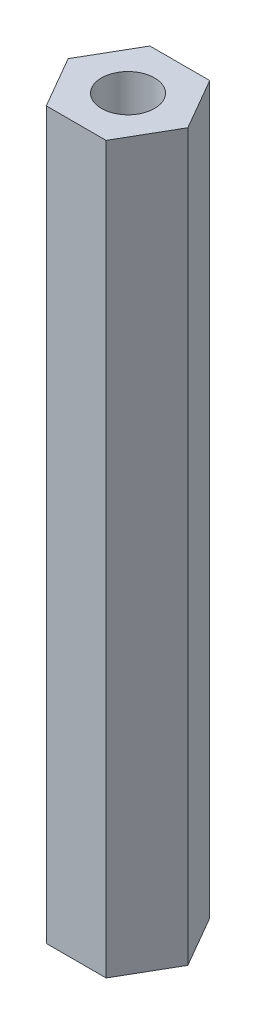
ISO-10303-21;
HEADER;
FILE_DESCRIPTION(('STEP AP214'),'2;1');
FILE_NAME('part.step','',(''),(''),'','','');
FILE_SCHEMA(('AUTOMOTIVE_DESIGN { 1 0 10303 214 1 1 1 1 }'));
ENDSEC;
DATA;
#1=APPLICATION_CONTEXT('core data for automotive mechanical design processes');
#2=APPLICATION_PROTOCOL_DEFINITION('international standard','automotive_design',2000,#1);
#3=PRODUCT_CONTEXT('',#1,'mechanical');
#4=PRODUCT('Part','Part','',(#3));
#5=PRODUCT_RELATED_PRODUCT_CATEGORY('part','',(#4));
#6=PRODUCT_DEFINITION_FORMATION('','',#4);
#7=PRODUCT_DEFINITION_CONTEXT('part definition',#1,'design');
#8=PRODUCT_DEFINITION('design','',#6,#7);
#9=PRODUCT_DEFINITION_SHAPE('','',#8);
#10=(LENGTH_UNIT() NAMED_UNIT(*) SI_UNIT(.MILLI.,.METRE.));
#11=(NAMED_UNIT(*) PLANE_ANGLE_UNIT() SI_UNIT($,.RADIAN.));
#12=(NAMED_UNIT(*) SI_UNIT($,.STERADIAN.) SOLID_ANGLE_UNIT());
#13=UNCERTAINTY_MEASURE_WITH_UNIT(LENGTH_MEASURE(1.E-05),#10,'distance_accuracy_value','');
#14=(GEOMETRIC_REPRESENTATION_CONTEXT(3) GLOBAL_UNCERTAINTY_ASSIGNED_CONTEXT((#13)) GLOBAL_UNIT_ASSIGNED_CONTEXT((#10,
#11,#12)) REPRESENTATION_CONTEXT('',''));
#15=CARTESIAN_POINT('',(0.,0.,0.));
#16=DIRECTION('',(0.,0.,1.));
#17=DIRECTION('',(1.,0.,0.));
#18=AXIS2_PLACEMENT_3D('',#15,#16,#17);
#19=CARTESIAN_POINT('',(0.,44.45,0.));
#20=DIRECTION('',(0.,1.,0.));
#21=DIRECTION('',(0.,0.,1.));
#22=AXIS2_PLACEMENT_3D('',#19,#20,#21);
#23=PLANE('',#22);
#24=DIRECTION('',(-0.500000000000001,0.,-0.866025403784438));
#25=VECTOR('',#24,1.);
#26=CARTESIAN_POINT('',(3.66617420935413,44.45,0.));
#27=LINE('',#26,#25);
#28=CARTESIAN_POINT('',(3.66617420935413,44.45,0.));
#29=VERTEX_POINT('',#28);
#30=CARTESIAN_POINT('',(1.83308710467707,44.45,-3.175));
#31=VERTEX_POINT('',#30);
#32=EDGE_CURVE('E128',#29,#31,#27,.T.);
#33=ORIENTED_EDGE('',*,*,#32,.T.);
#34=DIRECTION('',(-1.,0.,0.));
#35=VECTOR('',#34,1.);
#36=CARTESIAN_POINT('',(1.83308710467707,44.45,-3.175));
#37=LINE('',#36,#35);
#38=CARTESIAN_POINT('',(-1.83308710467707,44.45,-3.175));
#39=VERTEX_POINT('',#38);
#40=EDGE_CURVE('E86',#31,#39,#37,.T.);
#41=ORIENTED_EDGE('',*,*,#40,.T.);
#42=DIRECTION('',(-0.500000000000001,0.,0.866025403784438));
#43=VECTOR('',#42,1.);
#44=CARTESIAN_POINT('',(-1.83308710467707,44.45,-3.175));
#45=LINE('',#44,#43);
#46=CARTESIAN_POINT('',(-3.66617420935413,44.45,0.));
#47=VERTEX_POINT('',#46);
#48=EDGE_CURVE('E99',#39,#47,#45,.T.);
#49=ORIENTED_EDGE('',*,*,#48,.T.);
#50=DIRECTION('',(0.5,0.,0.866025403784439));
#51=VECTOR('',#50,1.);
#52=CARTESIAN_POINT('',(-3.66617420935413,44.45,0.));
#53=LINE('',#52,#51);
#54=CARTESIAN_POINT('',(-1.83308710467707,44.45,3.175));
#55=VERTEX_POINT('',#54);
#56=EDGE_CURVE('E93',#47,#55,#53,.T.);
#57=ORIENTED_EDGE('',*,*,#56,.T.);
#58=DIRECTION('',(1.,0.,0.));
#59=VECTOR('',#58,1.);
#60=CARTESIAN_POINT('',(-1.83308710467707,44.45,3.175));
#61=LINE('',#60,#59);
#62=CARTESIAN_POINT('',(1.83308710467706,44.45,3.175));
#63=VERTEX_POINT('',#62);
#64=EDGE_CURVE('E97',#55,#63,#61,.T.);
#65=ORIENTED_EDGE('',*,*,#64,.T.);
#66=DIRECTION('',(0.500000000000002,0.,-0.866025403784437));
#67=VECTOR('',#66,1.);
#68=CARTESIAN_POINT('',(1.83308710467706,44.45,3.175));
#69=LINE('',#68,#67);
#70=EDGE_CURVE('E49',#63,#29,#69,.T.);
#71=ORIENTED_EDGE('',*,*,#70,.T.);
#72=EDGE_LOOP('',(#33,#41,#49,#57,#65,#71));
#73=FACE_BOUND('',#72,.T.);
#74=CARTESIAN_POINT('',(0.,44.45,0.));
#75=DIRECTION('',(0.,1.,0.));
#76=DIRECTION('',(0.,0.,1.));
#77=AXIS2_PLACEMENT_3D('',#74,#75,#76);
#78=CIRCLE('',#77,1.6256);
#79=CARTESIAN_POINT('',(0.,44.45,1.6256));
#80=VERTEX_POINT('',#79);
#81=EDGE_CURVE('E121',#80,#80,#78,.T.);
#82=ORIENTED_EDGE('',*,*,#81,.F.);
#83=EDGE_LOOP('',(#82));
#84=FACE_BOUND('',#83,.T.);
#85=ADVANCED_FACE('F32',(#73,#84),#23,.T.);
#86=CARTESIAN_POINT('',(0.,0.,0.));
#87=DIRECTION('',(0.,1.,0.));
#88=DIRECTION('',(0.,0.,1.));
#89=AXIS2_PLACEMENT_3D('',#86,#87,#88);
#90=PLANE('',#89);
#91=DIRECTION('',(-0.500000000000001,0.,-0.866025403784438));
#92=VECTOR('',#91,1.);
#93=CARTESIAN_POINT('',(3.66617420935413,0.,0.));
#94=LINE('',#93,#92);
#95=CARTESIAN_POINT('',(3.66617420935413,0.,0.));
#96=VERTEX_POINT('',#95);
#97=CARTESIAN_POINT('',(1.83308710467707,0.,-3.175));
#98=VERTEX_POINT('',#97);
#99=EDGE_CURVE('E117',#96,#98,#94,.T.);
#100=ORIENTED_EDGE('',*,*,#99,.F.);
#101=DIRECTION('',(0.500000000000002,0.,-0.866025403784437));
#102=VECTOR('',#101,1.);
#103=CARTESIAN_POINT('',(1.83308710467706,0.,3.175));
#104=LINE('',#103,#102);
#105=CARTESIAN_POINT('',(1.83308710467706,0.,3.175));
#106=VERTEX_POINT('',#105);
#107=EDGE_CURVE('E78',#106,#96,#104,.T.);
#108=ORIENTED_EDGE('',*,*,#107,.F.);
#109=DIRECTION('',(1.,0.,0.));
#110=VECTOR('',#109,1.);
#111=CARTESIAN_POINT('',(-1.83308710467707,0.,3.175));
#112=LINE('',#111,#110);
#113=CARTESIAN_POINT('',(-1.83308710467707,0.,3.175));
#114=VERTEX_POINT('',#113);
#115=EDGE_CURVE('E72',#114,#106,#112,.T.);
#116=ORIENTED_EDGE('',*,*,#115,.F.);
#117=DIRECTION('',(0.5,0.,0.866025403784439));
#118=VECTOR('',#117,1.);
#119=CARTESIAN_POINT('',(-3.66617420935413,0.,0.));
#120=LINE('',#119,#118);
#121=CARTESIAN_POINT('',(-3.66617420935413,0.,0.));
#122=VERTEX_POINT('',#121);
#123=EDGE_CURVE('E107',#122,#114,#120,.T.);
#124=ORIENTED_EDGE('',*,*,#123,.F.);
#125=DIRECTION('',(-0.500000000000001,0.,0.866025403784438));
#126=VECTOR('',#125,1.);
#127=CARTESIAN_POINT('',(-1.83308710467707,0.,-3.175));
#128=LINE('',#127,#126);
#129=CARTESIAN_POINT('',(-1.83308710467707,0.,-3.175));
#130=VERTEX_POINT('',#129);
#131=EDGE_CURVE('E123',#130,#122,#128,.T.);
#132=ORIENTED_EDGE('',*,*,#131,.F.);
#133=DIRECTION('',(-1.,0.,0.));
#134=VECTOR('',#133,1.);
#135=CARTESIAN_POINT('',(1.83308710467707,0.,-3.175));
#136=LINE('',#135,#134);
#137=EDGE_CURVE('E120',#98,#130,#136,.T.);
#138=ORIENTED_EDGE('',*,*,#137,.F.);
#139=EDGE_LOOP('',(#100,#108,#116,#124,#132,#138));
#140=FACE_BOUND('',#139,.T.);
#141=CARTESIAN_POINT('',(0.,0.,0.));
#142=DIRECTION('',(0.,1.,0.));
#143=DIRECTION('',(0.,0.,1.));
#144=AXIS2_PLACEMENT_3D('',#141,#142,#143);
#145=CIRCLE('',#144,1.6256);
#146=CARTESIAN_POINT('',(0.,0.,1.6256));
#147=VERTEX_POINT('',#146);
#148=EDGE_CURVE('E221',#147,#147,#145,.T.);
#149=ORIENTED_EDGE('',*,*,#148,.T.);
#150=EDGE_LOOP('',(#149));
#151=FACE_BOUND('',#150,.T.);
#152=ADVANCED_FACE('F137',(#140,#151),#90,.F.);
#153=CARTESIAN_POINT('',(3.66617420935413,44.45,0.));
#154=DIRECTION('',(-0.866025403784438,0.,0.500000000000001));
#155=DIRECTION('',(0.500000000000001,0.,0.866025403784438));
#156=AXIS2_PLACEMENT_3D('',#153,#154,#155);
#157=PLANE('',#156);
#158=ORIENTED_EDGE('',*,*,#99,.T.);
#159=DIRECTION('',(0.,-1.,0.));
#160=VECTOR('',#159,1.);
#161=CARTESIAN_POINT('',(1.83308710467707,44.45,-3.175));
#162=LINE('',#161,#160);
#163=EDGE_CURVE('E11',#31,#98,#162,.T.);
#164=ORIENTED_EDGE('',*,*,#163,.F.);
#165=ORIENTED_EDGE('',*,*,#32,.F.);
#166=DIRECTION('',(0.,-1.,0.));
#167=VECTOR('',#166,1.);
#168=CARTESIAN_POINT('',(3.66617420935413,44.45,0.));
#169=LINE('',#168,#167);
#170=EDGE_CURVE('E113',#29,#96,#169,.T.);
#171=ORIENTED_EDGE('',*,*,#170,.T.);
#172=EDGE_LOOP('',(#158,#164,#165,#171));
#173=FACE_BOUND('',#172,.T.);
#174=ADVANCED_FACE('F34',(#173),#157,.F.);
#175=CARTESIAN_POINT('',(1.83308710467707,44.45,-3.175));
#176=DIRECTION('',(0.,0.,1.));
#177=DIRECTION('',(1.,0.,0.));
#178=AXIS2_PLACEMENT_3D('',#175,#176,#177);
#179=PLANE('',#178);
#180=ORIENTED_EDGE('',*,*,#137,.T.);
#181=DIRECTION('',(0.,-1.,0.));
#182=VECTOR('',#181,1.);
#183=CARTESIAN_POINT('',(-1.83308710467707,44.45,-3.175));
#184=LINE('',#183,#182);
#185=EDGE_CURVE('E41',#39,#130,#184,.T.);
#186=ORIENTED_EDGE('',*,*,#185,.F.);
#187=ORIENTED_EDGE('',*,*,#40,.F.);
#188=ORIENTED_EDGE('',*,*,#163,.T.);
#189=EDGE_LOOP('',(#180,#186,#187,#188));
#190=FACE_BOUND('',#189,.T.);
#191=ADVANCED_FACE('F162',(#190),#179,.F.);
#192=CARTESIAN_POINT('',(-1.83308710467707,44.45,-3.175));
#193=DIRECTION('',(0.866025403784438,0.,0.500000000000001));
#194=DIRECTION('',(0.500000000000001,0.,-0.866025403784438));
#195=AXIS2_PLACEMENT_3D('',#192,#193,#194);
#196=PLANE('',#195);
#197=ORIENTED_EDGE('',*,*,#131,.T.);
#198=DIRECTION('',(0.,-1.,0.));
#199=VECTOR('',#198,1.);
#200=CARTESIAN_POINT('',(-3.66617420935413,44.45,0.));
#201=LINE('',#200,#199);
#202=EDGE_CURVE('E108',#47,#122,#201,.T.);
#203=ORIENTED_EDGE('',*,*,#202,.F.);
#204=ORIENTED_EDGE('',*,*,#48,.F.);
#205=ORIENTED_EDGE('',*,*,#185,.T.);
#206=EDGE_LOOP('',(#197,#203,#204,#205));
#207=FACE_BOUND('',#206,.T.);
#208=ADVANCED_FACE('F134',(#207),#196,.F.);
#209=CARTESIAN_POINT('',(-3.66617420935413,44.45,0.));
#210=DIRECTION('',(0.866025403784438,0.,-0.5));
#211=DIRECTION('',(-0.5,0.,-0.866025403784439));
#212=AXIS2_PLACEMENT_3D('',#209,#210,#211);
#213=PLANE('',#212);
#214=ORIENTED_EDGE('',*,*,#123,.T.);
#215=DIRECTION('',(0.,-1.,0.));
#216=VECTOR('',#215,1.);
#217=CARTESIAN_POINT('',(-1.83308710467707,44.45,3.175));
#218=LINE('',#217,#216);
#219=EDGE_CURVE('E104',#55,#114,#218,.T.);
#220=ORIENTED_EDGE('',*,*,#219,.F.);
#221=ORIENTED_EDGE('',*,*,#56,.F.);
#222=ORIENTED_EDGE('',*,*,#202,.T.);
#223=EDGE_LOOP('',(#214,#220,#221,#222));
#224=FACE_BOUND('',#223,.T.);
#225=ADVANCED_FACE('F105',(#224),#213,.F.);
#226=CARTESIAN_POINT('',(-1.83308710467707,44.45,3.175));
#227=DIRECTION('',(0.,0.,-1.));
#228=DIRECTION('',(-1.,0.,0.));
#229=AXIS2_PLACEMENT_3D('',#226,#227,#228);
#230=PLANE('',#229);
#231=ORIENTED_EDGE('',*,*,#115,.T.);
#232=DIRECTION('',(0.,-1.,0.));
#233=VECTOR('',#232,1.);
#234=CARTESIAN_POINT('',(1.83308710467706,44.45,3.175));
#235=LINE('',#234,#233);
#236=EDGE_CURVE('E109',#63,#106,#235,.T.);
#237=ORIENTED_EDGE('',*,*,#236,.F.);
#238=ORIENTED_EDGE('',*,*,#64,.F.);
#239=ORIENTED_EDGE('',*,*,#219,.T.);
#240=EDGE_LOOP('',(#231,#237,#238,#239));
#241=FACE_BOUND('',#240,.T.);
#242=ADVANCED_FACE('F111',(#241),#230,.F.);
#243=CARTESIAN_POINT('',(1.83308710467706,44.45,3.175));
#244=DIRECTION('',(-0.866025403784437,0.,-0.500000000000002));
#245=DIRECTION('',(-0.500000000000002,0.,0.866025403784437));
#246=AXIS2_PLACEMENT_3D('',#243,#244,#245);
#247=PLANE('',#246);
#248=ORIENTED_EDGE('',*,*,#107,.T.);
#249=ORIENTED_EDGE('',*,*,#170,.F.);
#250=ORIENTED_EDGE('',*,*,#70,.F.);
#251=ORIENTED_EDGE('',*,*,#236,.T.);
#252=EDGE_LOOP('',(#248,#249,#250,#251));
#253=FACE_BOUND('',#252,.T.);
#254=ADVANCED_FACE('F142',(#253),#247,.F.);
#255=CARTESIAN_POINT('',(0.,44.45,0.));
#256=DIRECTION('',(0.,-1.,0.));
#257=DIRECTION('',(0.,0.,-1.));
#258=AXIS2_PLACEMENT_3D('',#255,#256,#257);
#259=CYLINDRICAL_SURFACE('',#258,1.6256);
#260=ORIENTED_EDGE('',*,*,#81,.T.);
#261=EDGE_LOOP('',(#260));
#262=FACE_BOUND('',#261,.T.);
#263=ORIENTED_EDGE('',*,*,#148,.F.);
#264=EDGE_LOOP('',(#263));
#265=FACE_BOUND('',#264,.T.);
#266=ADVANCED_FACE('F144',(#262,#265),#259,.F.);
#267=CLOSED_SHELL('',(#85,#152,#174,#191,#208,#225,#242,#254,#266));
#268=MANIFOLD_SOLID_BREP('B2',#267);
#269=ADVANCED_BREP_SHAPE_REPRESENTATION('',(#18,#268),#14);
#270=SHAPE_DEFINITION_REPRESENTATION(#9,#269);
ENDSEC;
END-ISO-10303-21;
